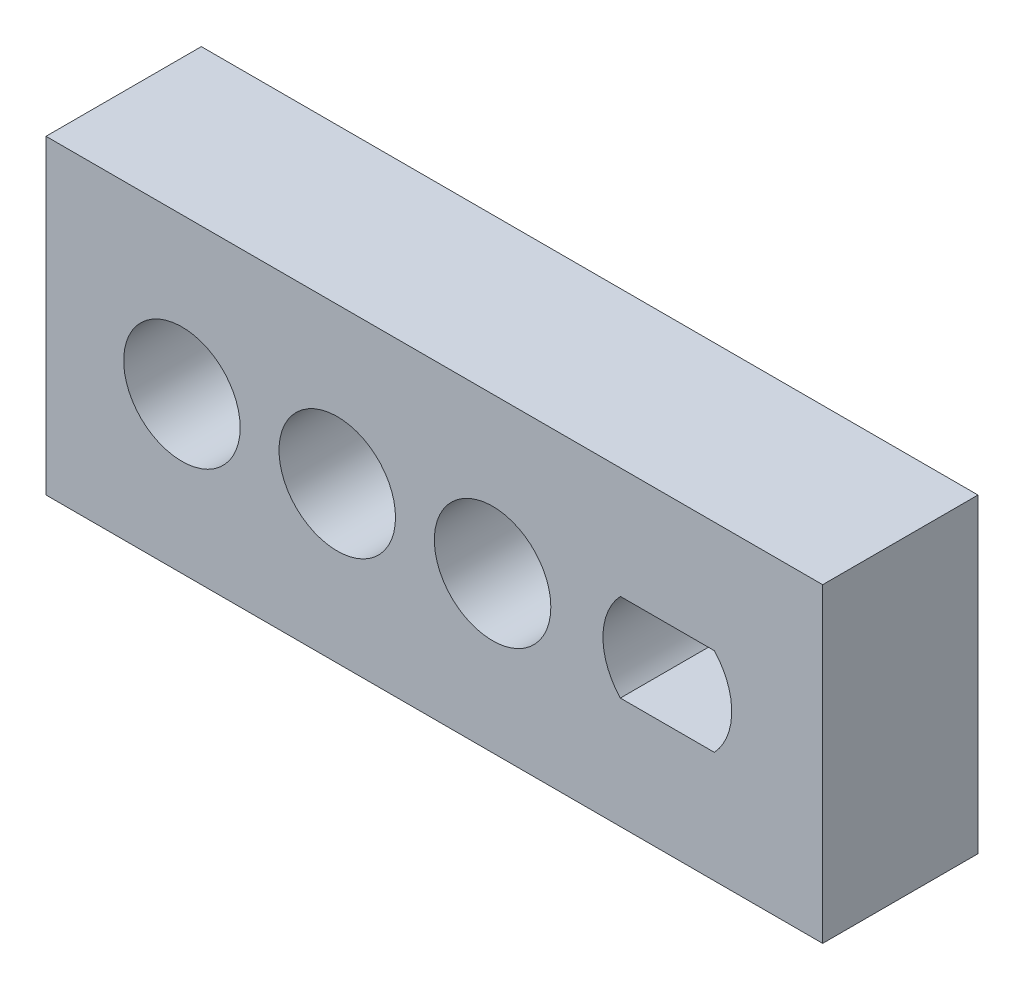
ISO-10303-21;
HEADER;
FILE_DESCRIPTION(('STEP AP214'),'2;1');
FILE_NAME('part.step','',(''),(''),'','','');
FILE_SCHEMA(('AUTOMOTIVE_DESIGN { 1 0 10303 214 1 1 1 1 }'));
ENDSEC;
DATA;
#1=APPLICATION_CONTEXT('core data for automotive mechanical design processes');
#2=APPLICATION_PROTOCOL_DEFINITION('international standard','automotive_design',2000,#1);
#3=PRODUCT_CONTEXT('',#1,'mechanical');
#4=PRODUCT('Part','Part','',(#3));
#5=PRODUCT_RELATED_PRODUCT_CATEGORY('part','',(#4));
#6=PRODUCT_DEFINITION_FORMATION('','',#4);
#7=PRODUCT_DEFINITION_CONTEXT('part definition',#1,'design');
#8=PRODUCT_DEFINITION('design','',#6,#7);
#9=PRODUCT_DEFINITION_SHAPE('','',#8);
#10=(LENGTH_UNIT() NAMED_UNIT(*) SI_UNIT(.MILLI.,.METRE.));
#11=(NAMED_UNIT(*) PLANE_ANGLE_UNIT() SI_UNIT($,.RADIAN.));
#12=(NAMED_UNIT(*) SI_UNIT($,.STERADIAN.) SOLID_ANGLE_UNIT());
#13=UNCERTAINTY_MEASURE_WITH_UNIT(LENGTH_MEASURE(1.E-05),#10,'distance_accuracy_value','');
#14=(GEOMETRIC_REPRESENTATION_CONTEXT(3) GLOBAL_UNCERTAINTY_ASSIGNED_CONTEXT((#13)) GLOBAL_UNIT_ASSIGNED_CONTEXT((#10,
#11,#12)) REPRESENTATION_CONTEXT('',''));
#15=CARTESIAN_POINT('',(0.,0.,0.));
#16=DIRECTION('',(0.,0.,1.));
#17=DIRECTION('',(1.,0.,0.));
#18=AXIS2_PLACEMENT_3D('',#15,#16,#17);
#19=CARTESIAN_POINT('',(-110.140954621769,50.4923550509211,25.4));
#20=DIRECTION('',(0.,0.,1.));
#21=DIRECTION('',(1.,0.,0.));
#22=AXIS2_PLACEMENT_3D('',#19,#20,#21);
#23=PLANE('',#22);
#24=CARTESIAN_POINT('',(-62.5159546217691,25.092355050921,25.4));
#25=DIRECTION('',(0.,0.,1.));
#26=DIRECTION('',(1.,0.,0.));
#27=AXIS2_PLACEMENT_3D('',#24,#25,#26);
#28=CIRCLE('',#27,9.525);
#29=CARTESIAN_POINT('',(-52.9909546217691,25.092355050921,25.4));
#30=VERTEX_POINT('',#29);
#31=EDGE_CURVE('E132',#30,#30,#28,.T.);
#32=ORIENTED_EDGE('',*,*,#31,.F.);
#33=EDGE_LOOP('',(#32));
#34=FACE_BOUND('',#33,.T.);
#35=CARTESIAN_POINT('',(-37.1159546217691,25.092355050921,25.4));
#36=DIRECTION('',(0.,0.,1.));
#37=DIRECTION('',(1.,0.,0.));
#38=AXIS2_PLACEMENT_3D('',#35,#36,#37);
#39=CIRCLE('',#38,9.525);
#40=CARTESIAN_POINT('',(-27.5909546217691,25.092355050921,25.4));
#41=VERTEX_POINT('',#40);
#42=EDGE_CURVE('E144',#41,#41,#39,.T.);
#43=ORIENTED_EDGE('',*,*,#42,.F.);
#44=EDGE_LOOP('',(#43));
#45=FACE_BOUND('',#44,.T.);
#46=DIRECTION('',(0.,-1.,0.));
#47=VECTOR('',#46,1.);
#48=CARTESIAN_POINT('',(-110.140954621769,50.4923550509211,25.4));
#49=LINE('',#48,#47);
#50=CARTESIAN_POINT('',(-110.140954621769,50.4923550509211,25.4));
#51=VERTEX_POINT('',#50);
#52=CARTESIAN_POINT('',(-110.140954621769,-0.307644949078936,25.4));
#53=VERTEX_POINT('',#52);
#54=EDGE_CURVE('E150',#51,#53,#49,.T.);
#55=ORIENTED_EDGE('',*,*,#54,.T.);
#56=DIRECTION('',(1.,0.,0.));
#57=VECTOR('',#56,1.);
#58=CARTESIAN_POINT('',(-110.140954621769,-0.307644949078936,25.4));
#59=LINE('',#58,#57);
#60=CARTESIAN_POINT('',(16.8590453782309,-0.307644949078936,25.4));
#61=VERTEX_POINT('',#60);
#62=EDGE_CURVE('E153',#53,#61,#59,.T.);
#63=ORIENTED_EDGE('',*,*,#62,.T.);
#64=DIRECTION('',(0.,1.,0.));
#65=VECTOR('',#64,1.);
#66=CARTESIAN_POINT('',(16.8590453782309,50.4923550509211,25.4));
#67=LINE('',#66,#65);
#68=CARTESIAN_POINT('',(16.8590453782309,50.4923550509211,25.4));
#69=VERTEX_POINT('',#68);
#70=EDGE_CURVE('E156',#61,#69,#67,.T.);
#71=ORIENTED_EDGE('',*,*,#70,.T.);
#72=DIRECTION('',(-1.,0.,0.));
#73=VECTOR('',#72,1.);
#74=CARTESIAN_POINT('',(-110.140954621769,50.4923550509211,25.4));
#75=LINE('',#74,#73);
#76=EDGE_CURVE('E158',#69,#51,#75,.T.);
#77=ORIENTED_EDGE('',*,*,#76,.T.);
#78=EDGE_LOOP('',(#55,#63,#71,#77));
#79=FACE_BOUND('',#78,.T.);
#80=CARTESIAN_POINT('',(-87.9159546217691,25.092355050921,25.4));
#81=DIRECTION('',(0.,0.,1.));
#82=DIRECTION('',(1.,0.,0.));
#83=AXIS2_PLACEMENT_3D('',#80,#81,#82);
#84=CIRCLE('',#83,9.52500000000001);
#85=CARTESIAN_POINT('',(-78.3909546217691,25.092355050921,25.4));
#86=VERTEX_POINT('',#85);
#87=EDGE_CURVE('E138',#86,#86,#84,.T.);
#88=ORIENTED_EDGE('',*,*,#87,.F.);
#89=EDGE_LOOP('',(#88));
#90=FACE_BOUND('',#89,.T.);
#91=DIRECTION('',(1.,0.,0.));
#92=VECTOR('',#91,1.);
#93=CARTESIAN_POINT('',(-8.54095462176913,17.8945131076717,25.4));
#94=LINE('',#93,#92);
#95=CARTESIAN_POINT('',(-16.2244546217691,17.8945131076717,25.4));
#96=VERTEX_POINT('',#95);
#97=CARTESIAN_POINT('',(-0.857454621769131,17.8945131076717,25.4));
#98=VERTEX_POINT('',#97);
#99=EDGE_CURVE('E114',#96,#98,#94,.T.);
#100=ORIENTED_EDGE('',*,*,#99,.F.);
#101=CARTESIAN_POINT('',(-8.54095462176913,25.0923550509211,25.4));
#102=DIRECTION('',(0.,0.,1.));
#103=DIRECTION('',(1.,0.,0.));
#104=AXIS2_PLACEMENT_3D('',#101,#102,#103);
#105=CIRCLE('',#104,10.5283);
#106=CARTESIAN_POINT('',(-16.2244546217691,32.2901969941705,25.4));
#107=VERTEX_POINT('',#106);
#108=EDGE_CURVE('E100',#107,#96,#105,.T.);
#109=ORIENTED_EDGE('',*,*,#108,.F.);
#110=DIRECTION('',(-1.,0.,0.));
#111=VECTOR('',#110,1.);
#112=CARTESIAN_POINT('',(-8.54095462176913,32.2901969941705,25.4));
#113=LINE('',#112,#111);
#114=CARTESIAN_POINT('',(-0.85745462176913,32.2901969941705,25.4));
#115=VERTEX_POINT('',#114);
#116=EDGE_CURVE('E95',#115,#107,#113,.T.);
#117=ORIENTED_EDGE('',*,*,#116,.F.);
#118=CARTESIAN_POINT('',(-8.54095462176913,25.0923550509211,25.4));
#119=DIRECTION('',(0.,0.,1.));
#120=DIRECTION('',(1.,0.,0.));
#121=AXIS2_PLACEMENT_3D('',#118,#119,#120);
#122=CIRCLE('',#121,10.5283);
#123=EDGE_CURVE('E116',#98,#115,#122,.T.);
#124=ORIENTED_EDGE('',*,*,#123,.F.);
#125=EDGE_LOOP('',(#100,#109,#117,#124));
#126=FACE_BOUND('',#125,.T.);
#127=ADVANCED_FACE('F33',(#34,#45,#79,#90,#126),#23,.T.);
#128=CARTESIAN_POINT('',(-110.140954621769,50.4923550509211,0.));
#129=DIRECTION('',(0.,0.,1.));
#130=DIRECTION('',(1.,0.,0.));
#131=AXIS2_PLACEMENT_3D('',#128,#129,#130);
#132=PLANE('',#131);
#133=CARTESIAN_POINT('',(-62.5159546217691,25.092355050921,0.));
#134=DIRECTION('',(0.,0.,1.));
#135=DIRECTION('',(1.,0.,0.));
#136=AXIS2_PLACEMENT_3D('',#133,#134,#135);
#137=CIRCLE('',#136,9.525);
#138=CARTESIAN_POINT('',(-52.9909546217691,25.092355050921,0.));
#139=VERTEX_POINT('',#138);
#140=EDGE_CURVE('E110',#139,#139,#137,.T.);
#141=ORIENTED_EDGE('',*,*,#140,.T.);
#142=EDGE_LOOP('',(#141));
#143=FACE_BOUND('',#142,.T.);
#144=CARTESIAN_POINT('',(-37.1159546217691,25.092355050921,0.));
#145=DIRECTION('',(0.,0.,1.));
#146=DIRECTION('',(1.,0.,0.));
#147=AXIS2_PLACEMENT_3D('',#144,#145,#146);
#148=CIRCLE('',#147,9.525);
#149=CARTESIAN_POINT('',(-27.5909546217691,25.092355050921,0.));
#150=VERTEX_POINT('',#149);
#151=EDGE_CURVE('E141',#150,#150,#148,.T.);
#152=ORIENTED_EDGE('',*,*,#151,.T.);
#153=EDGE_LOOP('',(#152));
#154=FACE_BOUND('',#153,.T.);
#155=DIRECTION('',(0.,-1.,0.));
#156=VECTOR('',#155,1.);
#157=CARTESIAN_POINT('',(-110.140954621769,50.4923550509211,0.));
#158=LINE('',#157,#156);
#159=CARTESIAN_POINT('',(-110.140954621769,50.4923550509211,0.));
#160=VERTEX_POINT('',#159);
#161=CARTESIAN_POINT('',(-110.140954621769,-0.307644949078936,0.));
#162=VERTEX_POINT('',#161);
#163=EDGE_CURVE('E147',#160,#162,#158,.T.);
#164=ORIENTED_EDGE('',*,*,#163,.F.);
#165=DIRECTION('',(-1.,0.,0.));
#166=VECTOR('',#165,1.);
#167=CARTESIAN_POINT('',(-110.140954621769,50.4923550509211,0.));
#168=LINE('',#167,#166);
#169=CARTESIAN_POINT('',(16.8590453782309,50.4923550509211,0.));
#170=VERTEX_POINT('',#169);
#171=EDGE_CURVE('E154',#170,#160,#168,.T.);
#172=ORIENTED_EDGE('',*,*,#171,.F.);
#173=DIRECTION('',(0.,1.,0.));
#174=VECTOR('',#173,1.);
#175=CARTESIAN_POINT('',(16.8590453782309,50.4923550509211,0.));
#176=LINE('',#175,#174);
#177=CARTESIAN_POINT('',(16.8590453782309,-0.307644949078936,0.));
#178=VERTEX_POINT('',#177);
#179=EDGE_CURVE('E165',#178,#170,#176,.T.);
#180=ORIENTED_EDGE('',*,*,#179,.F.);
#181=DIRECTION('',(1.,0.,0.));
#182=VECTOR('',#181,1.);
#183=CARTESIAN_POINT('',(-110.140954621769,-0.307644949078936,0.));
#184=LINE('',#183,#182);
#185=EDGE_CURVE('E163',#162,#178,#184,.T.);
#186=ORIENTED_EDGE('',*,*,#185,.F.);
#187=EDGE_LOOP('',(#164,#172,#180,#186));
#188=FACE_BOUND('',#187,.T.);
#189=CARTESIAN_POINT('',(-87.9159546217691,25.092355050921,0.));
#190=DIRECTION('',(0.,0.,1.));
#191=DIRECTION('',(1.,0.,0.));
#192=AXIS2_PLACEMENT_3D('',#189,#190,#191);
#193=CIRCLE('',#192,9.52500000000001);
#194=CARTESIAN_POINT('',(-78.3909546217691,25.092355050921,0.));
#195=VERTEX_POINT('',#194);
#196=EDGE_CURVE('E135',#195,#195,#193,.T.);
#197=ORIENTED_EDGE('',*,*,#196,.T.);
#198=EDGE_LOOP('',(#197));
#199=FACE_BOUND('',#198,.T.);
#200=CARTESIAN_POINT('',(-8.54095462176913,25.0923550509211,0.));
#201=DIRECTION('',(0.,0.,1.));
#202=DIRECTION('',(1.,0.,0.));
#203=AXIS2_PLACEMENT_3D('',#200,#201,#202);
#204=CIRCLE('',#203,10.5283);
#205=CARTESIAN_POINT('',(-16.2244546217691,32.2901969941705,0.));
#206=VERTEX_POINT('',#205);
#207=CARTESIAN_POINT('',(-16.2244546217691,17.8945131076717,0.));
#208=VERTEX_POINT('',#207);
#209=EDGE_CURVE('E108',#206,#208,#204,.T.);
#210=ORIENTED_EDGE('',*,*,#209,.T.);
#211=DIRECTION('',(1.,0.,0.));
#212=VECTOR('',#211,1.);
#213=CARTESIAN_POINT('',(-0.857454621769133,17.8945131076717,0.));
#214=LINE('',#213,#212);
#215=CARTESIAN_POINT('',(-0.857454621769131,17.8945131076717,0.));
#216=VERTEX_POINT('',#215);
#217=EDGE_CURVE('E121',#208,#216,#214,.T.);
#218=ORIENTED_EDGE('',*,*,#217,.T.);
#219=CARTESIAN_POINT('',(-8.54095462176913,25.0923550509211,0.));
#220=DIRECTION('',(0.,0.,1.));
#221=DIRECTION('',(1.,0.,0.));
#222=AXIS2_PLACEMENT_3D('',#219,#220,#221);
#223=CIRCLE('',#222,10.5283);
#224=CARTESIAN_POINT('',(-0.857454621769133,32.2901969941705,0.));
#225=VERTEX_POINT('',#224);
#226=EDGE_CURVE('E124',#216,#225,#223,.T.);
#227=ORIENTED_EDGE('',*,*,#226,.T.);
#228=DIRECTION('',(-1.,0.,0.));
#229=VECTOR('',#228,1.);
#230=CARTESIAN_POINT('',(-8.54095462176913,32.2901969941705,0.));
#231=LINE('',#230,#229);
#232=EDGE_CURVE('E101',#225,#206,#231,.T.);
#233=ORIENTED_EDGE('',*,*,#232,.T.);
#234=EDGE_LOOP('',(#210,#218,#227,#233));
#235=FACE_BOUND('',#234,.T.);
#236=ADVANCED_FACE('F183',(#143,#154,#188,#199,#235),#132,.F.);
#237=CARTESIAN_POINT('',(-110.140954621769,50.4923550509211,25.4));
#238=DIRECTION('',(1.,0.,0.));
#239=DIRECTION('',(0.,0.,-1.));
#240=AXIS2_PLACEMENT_3D('',#237,#238,#239);
#241=PLANE('',#240);
#242=ORIENTED_EDGE('',*,*,#163,.T.);
#243=DIRECTION('',(0.,0.,-1.));
#244=VECTOR('',#243,1.);
#245=CARTESIAN_POINT('',(-110.140954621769,-0.307644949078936,25.4));
#246=LINE('',#245,#244);
#247=EDGE_CURVE('E11',#53,#162,#246,.T.);
#248=ORIENTED_EDGE('',*,*,#247,.F.);
#249=ORIENTED_EDGE('',*,*,#54,.F.);
#250=DIRECTION('',(0.,0.,-1.));
#251=VECTOR('',#250,1.);
#252=CARTESIAN_POINT('',(-110.140954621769,50.4923550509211,25.4));
#253=LINE('',#252,#251);
#254=EDGE_CURVE('E160',#51,#160,#253,.T.);
#255=ORIENTED_EDGE('',*,*,#254,.T.);
#256=EDGE_LOOP('',(#242,#248,#249,#255));
#257=FACE_BOUND('',#256,.T.);
#258=ADVANCED_FACE('F35',(#257),#241,.F.);
#259=CARTESIAN_POINT('',(-110.140954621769,-0.307644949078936,25.4));
#260=DIRECTION('',(0.,1.,0.));
#261=DIRECTION('',(-1.,0.,0.));
#262=AXIS2_PLACEMENT_3D('',#259,#260,#261);
#263=PLANE('',#262);
#264=ORIENTED_EDGE('',*,*,#185,.T.);
#265=DIRECTION('',(0.,0.,-1.));
#266=VECTOR('',#265,1.);
#267=CARTESIAN_POINT('',(16.8590453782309,-0.307644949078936,25.4));
#268=LINE('',#267,#266);
#269=EDGE_CURVE('E41',#61,#178,#268,.T.);
#270=ORIENTED_EDGE('',*,*,#269,.F.);
#271=ORIENTED_EDGE('',*,*,#62,.F.);
#272=ORIENTED_EDGE('',*,*,#247,.T.);
#273=EDGE_LOOP('',(#264,#270,#271,#272));
#274=FACE_BOUND('',#273,.T.);
#275=ADVANCED_FACE('F194',(#274),#263,.F.);
#276=CARTESIAN_POINT('',(16.8590453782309,50.4923550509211,25.4));
#277=DIRECTION('',(-1.,0.,0.));
#278=DIRECTION('',(0.,-1.,0.));
#279=AXIS2_PLACEMENT_3D('',#276,#277,#278);
#280=PLANE('',#279);
#281=ORIENTED_EDGE('',*,*,#179,.T.);
#282=DIRECTION('',(0.,0.,-1.));
#283=VECTOR('',#282,1.);
#284=CARTESIAN_POINT('',(16.8590453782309,50.4923550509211,25.4));
#285=LINE('',#284,#283);
#286=EDGE_CURVE('E170',#69,#170,#285,.T.);
#287=ORIENTED_EDGE('',*,*,#286,.F.);
#288=ORIENTED_EDGE('',*,*,#70,.F.);
#289=ORIENTED_EDGE('',*,*,#269,.T.);
#290=EDGE_LOOP('',(#281,#287,#288,#289));
#291=FACE_BOUND('',#290,.T.);
#292=ADVANCED_FACE('F177',(#291),#280,.F.);
#293=CARTESIAN_POINT('',(-110.140954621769,50.4923550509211,25.4));
#294=DIRECTION('',(0.,-1.,0.));
#295=DIRECTION('',(0.,0.,-1.));
#296=AXIS2_PLACEMENT_3D('',#293,#294,#295);
#297=PLANE('',#296);
#298=ORIENTED_EDGE('',*,*,#171,.T.);
#299=ORIENTED_EDGE('',*,*,#254,.F.);
#300=ORIENTED_EDGE('',*,*,#76,.F.);
#301=ORIENTED_EDGE('',*,*,#286,.T.);
#302=EDGE_LOOP('',(#298,#299,#300,#301));
#303=FACE_BOUND('',#302,.T.);
#304=ADVANCED_FACE('F187',(#303),#297,.F.);
#305=CARTESIAN_POINT('',(-37.1159546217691,25.092355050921,25.4));
#306=DIRECTION('',(0.,0.,-1.));
#307=DIRECTION('',(-1.,0.,0.));
#308=AXIS2_PLACEMENT_3D('',#305,#306,#307);
#309=CYLINDRICAL_SURFACE('',#308,9.525);
#310=ORIENTED_EDGE('',*,*,#42,.T.);
#311=EDGE_LOOP('',(#310));
#312=FACE_BOUND('',#311,.T.);
#313=ORIENTED_EDGE('',*,*,#151,.F.);
#314=EDGE_LOOP('',(#313));
#315=FACE_BOUND('',#314,.T.);
#316=ADVANCED_FACE('F212',(#312,#315),#309,.F.);
#317=CARTESIAN_POINT('',(-87.9159546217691,25.092355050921,25.4));
#318=DIRECTION('',(0.,0.,-1.));
#319=DIRECTION('',(-1.,0.,0.));
#320=AXIS2_PLACEMENT_3D('',#317,#318,#319);
#321=CYLINDRICAL_SURFACE('',#320,9.52500000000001);
#322=ORIENTED_EDGE('',*,*,#87,.T.);
#323=EDGE_LOOP('',(#322));
#324=FACE_BOUND('',#323,.T.);
#325=ORIENTED_EDGE('',*,*,#196,.F.);
#326=EDGE_LOOP('',(#325));
#327=FACE_BOUND('',#326,.T.);
#328=ADVANCED_FACE('F219',(#324,#327),#321,.F.);
#329=CARTESIAN_POINT('',(-62.5159546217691,25.092355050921,25.4));
#330=DIRECTION('',(0.,0.,-1.));
#331=DIRECTION('',(-1.,0.,0.));
#332=AXIS2_PLACEMENT_3D('',#329,#330,#331);
#333=CYLINDRICAL_SURFACE('',#332,9.525);
#334=ORIENTED_EDGE('',*,*,#31,.T.);
#335=EDGE_LOOP('',(#334));
#336=FACE_BOUND('',#335,.T.);
#337=ORIENTED_EDGE('',*,*,#140,.F.);
#338=EDGE_LOOP('',(#337));
#339=FACE_BOUND('',#338,.T.);
#340=ADVANCED_FACE('F224',(#336,#339),#333,.F.);
#341=CARTESIAN_POINT('',(-8.54095462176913,25.0923550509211,25.4));
#342=DIRECTION('',(0.,0.,-1.));
#343=DIRECTION('',(-1.,0.,0.));
#344=AXIS2_PLACEMENT_3D('',#341,#342,#343);
#345=CYLINDRICAL_SURFACE('',#344,10.5283);
#346=ORIENTED_EDGE('',*,*,#209,.F.);
#347=DIRECTION('',(0.,0.,-1.));
#348=VECTOR('',#347,1.);
#349=CARTESIAN_POINT('',(-16.2244546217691,32.2901969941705,25.4));
#350=LINE('',#349,#348);
#351=EDGE_CURVE('E53',#107,#206,#350,.T.);
#352=ORIENTED_EDGE('',*,*,#351,.F.);
#353=ORIENTED_EDGE('',*,*,#108,.T.);
#354=DIRECTION('',(0.,0.,-1.));
#355=VECTOR('',#354,1.);
#356=CARTESIAN_POINT('',(-16.2244546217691,17.8945131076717,25.4));
#357=LINE('',#356,#355);
#358=EDGE_CURVE('E111',#96,#208,#357,.T.);
#359=ORIENTED_EDGE('',*,*,#358,.T.);
#360=EDGE_LOOP('',(#346,#352,#353,#359));
#361=FACE_BOUND('',#360,.T.);
#362=ADVANCED_FACE('F104',(#361),#345,.F.);
#363=CARTESIAN_POINT('',(-0.857454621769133,17.8945131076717,25.4));
#364=DIRECTION('',(0.,1.,0.));
#365=DIRECTION('',(-1.,0.,0.));
#366=AXIS2_PLACEMENT_3D('',#363,#364,#365);
#367=PLANE('',#366);
#368=ORIENTED_EDGE('',*,*,#217,.F.);
#369=ORIENTED_EDGE('',*,*,#358,.F.);
#370=ORIENTED_EDGE('',*,*,#99,.T.);
#371=DIRECTION('',(0.,0.,-1.));
#372=VECTOR('',#371,1.);
#373=CARTESIAN_POINT('',(-0.857454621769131,17.8945131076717,25.4));
#374=LINE('',#373,#372);
#375=EDGE_CURVE('E129',#98,#216,#374,.T.);
#376=ORIENTED_EDGE('',*,*,#375,.T.);
#377=EDGE_LOOP('',(#368,#369,#370,#376));
#378=FACE_BOUND('',#377,.T.);
#379=ADVANCED_FACE('F239',(#378),#367,.T.);
#380=CARTESIAN_POINT('',(-8.54095462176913,25.0923550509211,25.4));
#381=DIRECTION('',(0.,0.,-1.));
#382=DIRECTION('',(-1.,0.,0.));
#383=AXIS2_PLACEMENT_3D('',#380,#381,#382);
#384=CYLINDRICAL_SURFACE('',#383,10.5283);
#385=ORIENTED_EDGE('',*,*,#226,.F.);
#386=ORIENTED_EDGE('',*,*,#375,.F.);
#387=ORIENTED_EDGE('',*,*,#123,.T.);
#388=DIRECTION('',(0.,0.,-1.));
#389=VECTOR('',#388,1.);
#390=CARTESIAN_POINT('',(-0.857454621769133,32.2901969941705,25.4));
#391=LINE('',#390,#389);
#392=EDGE_CURVE('E48',#115,#225,#391,.T.);
#393=ORIENTED_EDGE('',*,*,#392,.T.);
#394=EDGE_LOOP('',(#385,#386,#387,#393));
#395=FACE_BOUND('',#394,.T.);
#396=ADVANCED_FACE('F242',(#395),#384,.F.);
#397=CARTESIAN_POINT('',(-8.54095462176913,32.2901969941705,25.4));
#398=DIRECTION('',(0.,-1.,0.));
#399=DIRECTION('',(0.,0.,-1.));
#400=AXIS2_PLACEMENT_3D('',#397,#398,#399);
#401=PLANE('',#400);
#402=ORIENTED_EDGE('',*,*,#232,.F.);
#403=ORIENTED_EDGE('',*,*,#392,.F.);
#404=ORIENTED_EDGE('',*,*,#116,.T.);
#405=ORIENTED_EDGE('',*,*,#351,.T.);
#406=EDGE_LOOP('',(#402,#403,#404,#405));
#407=FACE_BOUND('',#406,.T.);
#408=ADVANCED_FACE('F96',(#407),#401,.T.);
#409=CLOSED_SHELL('',(#127,#236,#258,#275,#292,#304,#316,#328,#340,#362,#379,#396,#408));
#410=MANIFOLD_SOLID_BREP('B2',#409);
#411=ADVANCED_BREP_SHAPE_REPRESENTATION('',(#18,#410),#14);
#412=SHAPE_DEFINITION_REPRESENTATION(#9,#411);
ENDSEC;
END-ISO-10303-21;
